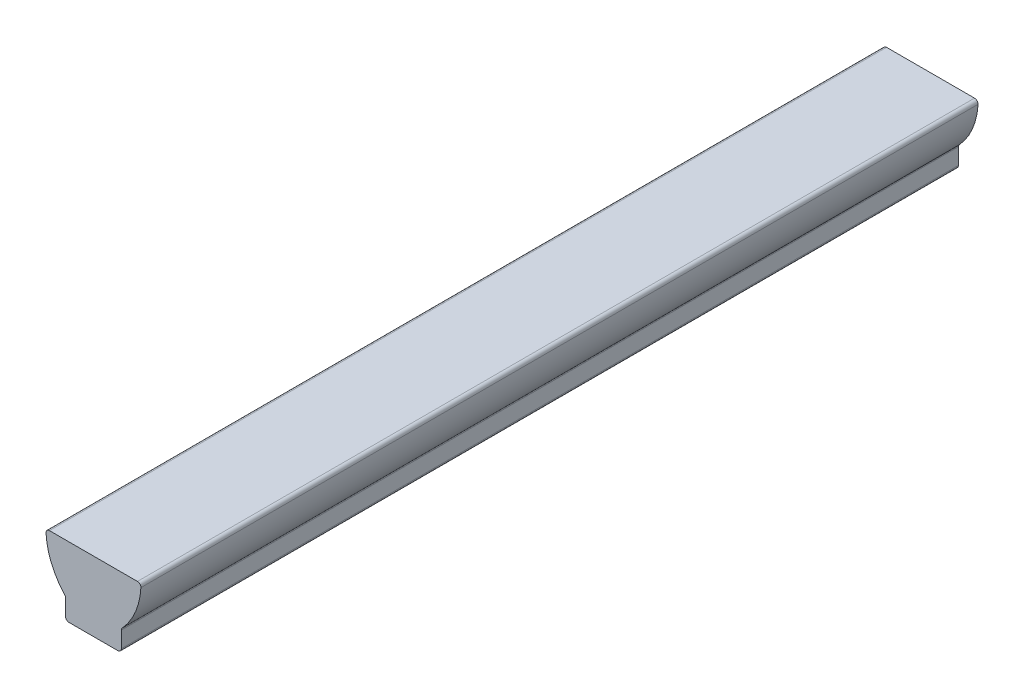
ISO-10303-21;
HEADER;
FILE_DESCRIPTION(('STEP AP214'),'2;1');
FILE_NAME('part.step','',(''),(''),'','','');
FILE_SCHEMA(('AUTOMOTIVE_DESIGN { 1 0 10303 214 1 1 1 1 }'));
ENDSEC;
DATA;
#1=APPLICATION_CONTEXT('core data for automotive mechanical design processes');
#2=APPLICATION_PROTOCOL_DEFINITION('international standard','automotive_design',2000,#1);
#3=PRODUCT_CONTEXT('',#1,'mechanical');
#4=PRODUCT('Part','Part','',(#3));
#5=PRODUCT_RELATED_PRODUCT_CATEGORY('part','',(#4));
#6=PRODUCT_DEFINITION_FORMATION('','',#4);
#7=PRODUCT_DEFINITION_CONTEXT('part definition',#1,'design');
#8=PRODUCT_DEFINITION('design','',#6,#7);
#9=PRODUCT_DEFINITION_SHAPE('','',#8);
#10=(LENGTH_UNIT() NAMED_UNIT(*) SI_UNIT(.MILLI.,.METRE.));
#11=(NAMED_UNIT(*) PLANE_ANGLE_UNIT() SI_UNIT($,.RADIAN.));
#12=(NAMED_UNIT(*) SI_UNIT($,.STERADIAN.) SOLID_ANGLE_UNIT());
#13=UNCERTAINTY_MEASURE_WITH_UNIT(LENGTH_MEASURE(1.E-05),#10,'distance_accuracy_value','');
#14=(GEOMETRIC_REPRESENTATION_CONTEXT(3) GLOBAL_UNCERTAINTY_ASSIGNED_CONTEXT((#13)) GLOBAL_UNIT_ASSIGNED_CONTEXT((#10,
#11,#12)) REPRESENTATION_CONTEXT('',''));
#15=CARTESIAN_POINT('',(0.,0.,0.));
#16=DIRECTION('',(0.,0.,1.));
#17=DIRECTION('',(1.,0.,0.));
#18=AXIS2_PLACEMENT_3D('',#15,#16,#17);
#19=CARTESIAN_POINT('',(-5.56260000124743,-14.8932834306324,189.865));
#20=CARTESIAN_POINT('',(-5.66701573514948,-14.8932834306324,189.865));
#21=CARTESIAN_POINT('',(-5.76745738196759,-14.8733043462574,189.865));
#22=CARTESIAN_POINT('',(-5.86392494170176,-14.8333461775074,189.865));
#23=CARTESIAN_POINT('',(-5.96039250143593,-14.7933880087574,189.865));
#24=CARTESIAN_POINT('',(-6.04554281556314,-14.7364923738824,189.865));
#25=CARTESIAN_POINT('',(-6.11937588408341,-14.6626593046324,189.865));
#26=CARTESIAN_POINT('',(-6.19320895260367,-14.5888262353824,189.865));
#27=CARTESIAN_POINT('',(-6.2501045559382,-14.5036759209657,189.865));
#28=CARTESIAN_POINT('',(-6.29006273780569,-14.4072083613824,189.865));
#29=CARTESIAN_POINT('',(-6.33002091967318,-14.3107408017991,189.865));
#30=CARTESIAN_POINT('',(-6.35000001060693,-14.2102991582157,189.865));
#31=CARTESIAN_POINT('',(-6.35000001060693,-14.1058834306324,189.865));
#32=CARTESIAN_POINT('',(-5.56260000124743,-14.8932834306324,-0.635));
#33=CARTESIAN_POINT('',(-5.66701573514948,-14.8932834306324,-0.635));
#34=CARTESIAN_POINT('',(-5.76745738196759,-14.8733043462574,-0.635));
#35=CARTESIAN_POINT('',(-5.86392494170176,-14.8333461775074,-0.635));
#36=CARTESIAN_POINT('',(-5.96039250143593,-14.7933880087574,-0.635));
#37=CARTESIAN_POINT('',(-6.04554281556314,-14.7364923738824,-0.635));
#38=CARTESIAN_POINT('',(-6.11937588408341,-14.6626593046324,-0.635));
#39=CARTESIAN_POINT('',(-6.19320895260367,-14.5888262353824,-0.635));
#40=CARTESIAN_POINT('',(-6.2501045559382,-14.5036759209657,-0.635));
#41=CARTESIAN_POINT('',(-6.29006273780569,-14.4072083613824,-0.635));
#42=CARTESIAN_POINT('',(-6.33002091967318,-14.3107408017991,-0.635));
#43=CARTESIAN_POINT('',(-6.35000001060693,-14.2102991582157,-0.635));
#44=CARTESIAN_POINT('',(-6.35000001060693,-14.1058834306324,-0.635));
#45=B_SPLINE_SURFACE_WITH_KNOTS('',1,3,((#19,#20,#21,#22,#23,#24,#25,#26,#27,#28,#29,#30,#31),
(#32,#33,#34,#35,#36,#37,#38,#39,#40,#41,#42,#43,#44)),.UNSPECIFIED.,.F.,.F.,.F.,(2,2),(4,3,3,3,
4),(0.,1.),(0.,0.25,0.5,0.75,1.),.UNSPECIFIED.);
#46=DIRECTION('',(0.,0.,1.));
#47=VECTOR('',#46,1.);
#48=CARTESIAN_POINT('',(-5.56260000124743,-14.8932834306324,94.615));
#49=LINE('',#48,#47);
#50=CARTESIAN_POINT('',(-5.56260000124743,-14.8932834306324,-0.635000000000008));
#51=VERTEX_POINT('',#50);
#52=CARTESIAN_POINT('',(-5.56260000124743,-14.8932834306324,189.865));
#53=VERTEX_POINT('',#52);
#54=EDGE_CURVE('E115',#51,#53,#49,.T.);
#55=CARTESIAN_POINT('',(-6.35000001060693,-14.1058834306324,189.865));
#56=CARTESIAN_POINT('',(-6.35000953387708,-14.1280868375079,189.865));
#57=CARTESIAN_POINT('',(-6.3490972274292,-14.1502942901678,189.865));
#58=CARTESIAN_POINT('',(-6.34540518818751,-14.1945444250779,189.865));
#59=CARTESIAN_POINT('',(-6.3426261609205,-14.2165871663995,189.865));
#60=CARTESIAN_POINT('',(-6.33517917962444,-14.2603389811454,189.865));
#61=CARTESIAN_POINT('',(-6.33051235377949,-14.2820482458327,189.865));
#62=CARTESIAN_POINT('',(-6.31933104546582,-14.3249869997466,189.865));
#63=CARTESIAN_POINT('',(-6.31281634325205,-14.3462164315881,189.865));
#64=CARTESIAN_POINT('',(-6.29804475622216,-14.3880604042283,189.865));
#65=CARTESIAN_POINT('',(-6.28978772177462,-14.408674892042,189.865));
#66=CARTESIAN_POINT('',(-6.27161137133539,-14.4491571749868,189.865));
#67=CARTESIAN_POINT('',(-6.26169216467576,-14.4690250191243,189.865));
#68=CARTESIAN_POINT('',(-6.24019088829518,-14.5078389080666,189.865));
#69=CARTESIAN_POINT('',(-6.22860898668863,-14.5267850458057,189.865));
#70=CARTESIAN_POINT('',(-6.2038563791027,-14.5636088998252,189.865));
#71=CARTESIAN_POINT('',(-6.19068569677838,-14.581486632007,189.865));
#72=CARTESIAN_POINT('',(-6.16290152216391,-14.6160076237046,189.865));
#73=CARTESIAN_POINT('',(-6.14829170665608,-14.6326538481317,189.865));
#74=CARTESIAN_POINT('',(-6.11776205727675,-14.6646999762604,189.865));
#75=CARTESIAN_POINT('',(-6.10184207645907,-14.6800997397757,189.865));
#76=CARTESIAN_POINT('',(-6.06876791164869,-14.7095282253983,189.865));
#77=CARTESIAN_POINT('',(-6.05161330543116,-14.7235564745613,189.865));
#78=CARTESIAN_POINT('',(-6.0161717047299,-14.7500867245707,189.865));
#79=CARTESIAN_POINT('',(-5.99788494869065,-14.7625890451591,189.865));
#80=CARTESIAN_POINT('',(-5.94141257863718,-14.7977209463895,189.865));
#81=CARTESIAN_POINT('',(-5.90168268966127,-14.8179150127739,189.865));
#82=CARTESIAN_POINT('',(-5.81948846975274,-14.8515265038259,189.865));
#83=CARTESIAN_POINT('',(-5.77702593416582,-14.8649483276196,189.865));
#84=CARTESIAN_POINT('',(-5.70565895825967,-14.8808740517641,189.865));
#85=CARTESIAN_POINT('',(-5.67722883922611,-14.8855567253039,189.865));
#86=CARTESIAN_POINT('',(-5.62006497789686,-14.8917706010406,189.865));
#87=CARTESIAN_POINT('',(-5.591331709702,-14.8933061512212,189.865));
#88=CARTESIAN_POINT('',(-5.56260000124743,-14.8932834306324,189.865));
#89=B_SPLINE_CURVE_WITH_KNOTS('',3,(#55,#56,#57,#58,#59,#60,#61,#62,#63,#64,#65,#66,#67,#68,#69,
#70,#71,#72,#73,#74,#75,#76,#77,#78,#79,#80,#81,#82,#83,#84,#85,#86,#87,#88),.UNSPECIFIED.,.F.,
.F.,(4,2,2,2,2,2,2,2,2,2,2,2,2,2,2,2,4),(0.,0.066596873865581,0.133168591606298,
0.199700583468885,0.266240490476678,0.332786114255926,0.399327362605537,0.465861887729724,
0.532395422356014,0.598763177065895,0.665138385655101,0.731536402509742,0.797920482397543,
0.930957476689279,1.06390794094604,1.15017818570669,1.23632916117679),.UNSPECIFIED.);
#90=CARTESIAN_POINT('',(-6.35000001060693,-14.1058834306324,189.865));
#91=VERTEX_POINT('',#90);
#92=EDGE_CURVE('E18',#91,#53,#89,.T.);
#93=DIRECTION('',(0.,0.,-1.));
#94=VECTOR('',#93,1.);
#95=CARTESIAN_POINT('',(-6.35000001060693,-14.1058834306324,94.615));
#96=LINE('',#95,#94);
#97=CARTESIAN_POINT('',(-6.35000001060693,-14.1058834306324,-0.635));
#98=VERTEX_POINT('',#97);
#99=EDGE_CURVE('E120',#91,#98,#96,.T.);
#100=CARTESIAN_POINT('',(-5.56260000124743,-14.8932834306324,-0.635));
#101=CARTESIAN_POINT('',(-5.5848034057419,-14.8932929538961,-0.635));
#102=CARTESIAN_POINT('',(-5.60701085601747,-14.8923806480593,-0.635));
#103=CARTESIAN_POINT('',(-5.65126098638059,-14.8886886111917,-0.635));
#104=CARTESIAN_POINT('',(-5.67330372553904,-14.8859095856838,-0.635));
#105=CARTESIAN_POINT('',(-5.71705553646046,-14.8784626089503,-0.635));
#106=CARTESIAN_POINT('',(-5.73876479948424,-14.8737957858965,-0.635));
#107=CARTESIAN_POINT('',(-5.78170355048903,-14.8626144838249,-0.635));
#108=CARTESIAN_POINT('',(-5.80293298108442,-14.8560997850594,-0.635));
#109=CARTESIAN_POINT('',(-5.84477695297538,-14.8413282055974,-0.635));
#110=CARTESIAN_POINT('',(-5.86539144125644,-14.833071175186,-0.635));
#111=CARTESIAN_POINT('',(-5.90587372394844,-14.8148948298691,-0.635));
#112=CARTESIAN_POINT('',(-5.92574156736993,-14.8049756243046,-0.635));
#113=CARTESIAN_POINT('',(-5.96455545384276,-14.7834743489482,-0.635));
#114=CARTESIAN_POINT('',(-5.98350158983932,-14.7718924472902,-0.635));
#115=CARTESIAN_POINT('',(-6.02032544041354,-14.747139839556,-0.635));
#116=CARTESIAN_POINT('',(-6.03820317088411,-14.7339691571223,-0.635));
#117=CARTESIAN_POINT('',(-6.07272415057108,-14.7061849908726,-0.635));
#118=CARTESIAN_POINT('',(-6.08937036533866,-14.6915751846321,-0.635));
#119=CARTESIAN_POINT('',(-6.12141647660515,-14.6610455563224,-0.635));
#120=CARTESIAN_POINT('',(-6.13681623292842,-14.6451255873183,-0.635));
#121=CARTESIAN_POINT('',(-6.16624470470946,-14.6120514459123,-0.635));
#122=CARTESIAN_POINT('',(-6.1802729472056,-14.5948968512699,-0.635));
#123=CARTESIAN_POINT('',(-6.20680318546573,-14.5594552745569,-0.635));
#124=CARTESIAN_POINT('',(-6.21930550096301,-14.5411685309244,-0.635));
#125=CARTESIAN_POINT('',(-6.25443740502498,-14.4846961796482,-0.635));
#126=CARTESIAN_POINT('',(-6.27463148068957,-14.4449662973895,-0.635));
#127=CARTESIAN_POINT('',(-6.30824299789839,-14.3627720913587,-0.635));
#128=CARTESIAN_POINT('',(-6.32166483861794,-14.3203095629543,-0.635));
#129=CARTESIAN_POINT('',(-6.3375905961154,-14.2489425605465,-0.635));
#130=CARTESIAN_POINT('',(-6.34227328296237,-14.2205124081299,-0.635));
#131=CARTESIAN_POINT('',(-6.34848717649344,-14.1633484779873,-0.635));
#132=CARTESIAN_POINT('',(-6.35002273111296,-14.1346151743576,-0.635));
#133=CARTESIAN_POINT('',(-6.35000001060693,-14.1058834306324,-0.635));
#134=B_SPLINE_CURVE_WITH_KNOTS('',3,(#100,#101,#102,#103,#104,#105,#106,#107,#108,#109,#110,
#111,#112,#113,#114,#115,#116,#117,#118,#119,#120,#121,#122,#123,#124,#125,#126,#127,#128,#129,
#130,#131,#132,#133),.UNSPECIFIED.,.F.,.F.,(4,2,2,2,2,2,2,2,2,2,2,2,2,2,2,2,4),(0.,
0.066596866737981,0.133168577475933,0.199700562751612,0.266240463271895,0.33278608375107,
0.399327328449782,0.465861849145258,0.532395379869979,0.598763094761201,0.665138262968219,
0.731536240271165,0.797920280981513,0.930957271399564,1.06390773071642,1.15017807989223,
1.23632916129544),.UNSPECIFIED.);
#135=EDGE_CURVE('E113',#51,#98,#134,.T.);
#136=ORIENTED_EDGE('',*,*,#54,.T.);
#137=ORIENTED_EDGE('',*,*,#92,.F.);
#138=ORIENTED_EDGE('',*,*,#99,.T.);
#139=ORIENTED_EDGE('',*,*,#135,.F.);
#140=EDGE_LOOP('',(#136,#137,#138,#139));
#141=FACE_BOUND('',#140,.T.);
#142=ADVANCED_FACE('F14',(#141),#45,.F.);
#143=CARTESIAN_POINT('',(6.35000001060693,-14.1058834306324,189.865));
#144=CARTESIAN_POINT('',(6.35000001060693,-14.2102991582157,189.865));
#145=CARTESIAN_POINT('',(6.33002090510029,-14.3107408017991,189.865));
#146=CARTESIAN_POINT('',(6.29006273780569,-14.4072083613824,189.865));
#147=CARTESIAN_POINT('',(6.2501045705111,-14.5036759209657,189.865));
#148=CARTESIAN_POINT('',(6.19320895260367,-14.5888262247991,189.865));
#149=CARTESIAN_POINT('',(6.11937588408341,-14.6626593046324,189.865));
#150=CARTESIAN_POINT('',(6.04554281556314,-14.7364923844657,189.865));
#151=CARTESIAN_POINT('',(5.96039250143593,-14.7933880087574,189.865));
#152=CARTESIAN_POINT('',(5.86392494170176,-14.8333461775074,189.865));
#153=CARTESIAN_POINT('',(5.76745738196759,-14.8733043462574,189.865));
#154=CARTESIAN_POINT('',(5.66701573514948,-14.8932834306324,189.865));
#155=CARTESIAN_POINT('',(5.56260000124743,-14.8932834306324,189.865));
#156=CARTESIAN_POINT('',(6.35000001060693,-14.1058834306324,-0.635));
#157=CARTESIAN_POINT('',(6.35000001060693,-14.2102991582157,-0.635));
#158=CARTESIAN_POINT('',(6.33002090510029,-14.3107408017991,-0.635));
#159=CARTESIAN_POINT('',(6.29006273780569,-14.4072083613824,-0.635));
#160=CARTESIAN_POINT('',(6.2501045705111,-14.5036759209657,-0.635));
#161=CARTESIAN_POINT('',(6.19320895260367,-14.5888262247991,-0.635));
#162=CARTESIAN_POINT('',(6.11937588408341,-14.6626593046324,-0.635));
#163=CARTESIAN_POINT('',(6.04554281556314,-14.7364923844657,-0.635));
#164=CARTESIAN_POINT('',(5.96039250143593,-14.7933880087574,-0.635));
#165=CARTESIAN_POINT('',(5.86392494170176,-14.8333461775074,-0.635));
#166=CARTESIAN_POINT('',(5.76745738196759,-14.8733043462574,-0.635));
#167=CARTESIAN_POINT('',(5.66701573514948,-14.8932834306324,-0.635));
#168=CARTESIAN_POINT('',(5.56260000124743,-14.8932834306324,-0.635));
#169=B_SPLINE_SURFACE_WITH_KNOTS('',1,3,((#143,#144,#145,#146,#147,#148,#149,#150,#151,#152,
#153,#154,#155),(#156,#157,#158,#159,#160,#161,#162,#163,#164,#165,#166,#167,#168)),
.UNSPECIFIED.,.F.,.F.,.F.,(2,2),(4,3,3,3,4),(0.,1.),(0.,0.25,0.5,0.75,1.),.UNSPECIFIED.);
#170=DIRECTION('',(0.,0.,1.));
#171=VECTOR('',#170,1.);
#172=CARTESIAN_POINT('',(6.35000001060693,-14.1058834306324,94.615));
#173=LINE('',#172,#171);
#174=CARTESIAN_POINT('',(6.35000001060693,-14.1058834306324,-0.635));
#175=VERTEX_POINT('',#174);
#176=CARTESIAN_POINT('',(6.35000001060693,-14.1058834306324,189.865));
#177=VERTEX_POINT('',#176);
#178=EDGE_CURVE('E154',#175,#177,#173,.T.);
#179=CARTESIAN_POINT('',(5.56260000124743,-14.8932834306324,189.865));
#180=CARTESIAN_POINT('',(5.58480340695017,-14.8932929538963,189.865));
#181=CARTESIAN_POINT('',(5.60701085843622,-14.89238064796,189.865));
#182=CARTESIAN_POINT('',(5.65126099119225,-14.8886886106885,189.865));
#183=CARTESIAN_POINT('',(5.67330373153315,-14.8859095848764,189.865));
#184=CARTESIAN_POINT('',(5.71705554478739,-14.8784626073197,189.865));
#185=CARTESIAN_POINT('',(5.7387648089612,-14.8737957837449,189.865));
#186=CARTESIAN_POINT('',(5.78170356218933,-14.8626144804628,189.865));
#187=CARTESIAN_POINT('',(5.80293299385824,-14.8560997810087,189.865));
#188=CARTESIAN_POINT('',(5.84477696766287,-14.8413281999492,189.865));
#189=CARTESIAN_POINT('',(5.86539145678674,-14.8330711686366,189.865));
#190=CARTESIAN_POINT('',(5.9058737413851,-14.8148948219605,189.865));
#191=CARTESIAN_POINT('',(5.92574158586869,-14.8049756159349,189.865));
#192=CARTESIAN_POINT('',(5.96455547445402,-14.7834743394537,189.865));
#193=CARTESIAN_POINT('',(5.98350161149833,-14.7718924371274,189.865));
#194=CARTESIAN_POINT('',(6.02032546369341,-14.7471398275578,189.865));
#195=CARTESIAN_POINT('',(6.03820319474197,-14.7339691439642,189.865));
#196=CARTESIAN_POINT('',(6.07272417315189,-14.706184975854,189.865));
#197=CARTESIAN_POINT('',(6.08937038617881,-14.6915751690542,189.865));
#198=CARTESIAN_POINT('',(6.12141649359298,-14.6610455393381,189.865));
#199=CARTESIAN_POINT('',(6.1368162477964,-14.6451255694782,189.865));
#200=CARTESIAN_POINT('',(6.16624471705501,-14.6120514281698,189.865));
#201=CARTESIAN_POINT('',(6.18027295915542,-14.594896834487,189.865));
#202=CARTESIAN_POINT('',(6.20680319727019,-14.5594552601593,189.865));
#203=CARTESIAN_POINT('',(6.21930551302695,-14.5411685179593,189.865));
#204=CARTESIAN_POINT('',(6.25443742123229,-14.484696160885,189.865));
#205=CARTESIAN_POINT('',(6.27463149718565,-14.4449662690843,189.865));
#206=CARTESIAN_POINT('',(6.3082430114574,-14.3627720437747,189.865));
#207=CARTESIAN_POINT('',(6.32166484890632,-14.3203095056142,189.865));
#208=CARTESIAN_POINT('',(6.33759060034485,-14.2489425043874,189.865));
#209=CARTESIAN_POINT('',(6.34227328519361,-14.2205123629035,189.865));
#210=CARTESIAN_POINT('',(6.34848717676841,-14.1633484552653,189.865));
#211=CARTESIAN_POINT('',(6.35002273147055,-14.1346151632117,189.865));
#212=CARTESIAN_POINT('',(6.35000001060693,-14.1058834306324,189.865));
#213=B_SPLINE_CURVE_WITH_KNOTS('',3,(#179,#180,#181,#182,#183,#184,#185,#186,#187,#188,#189,
#190,#191,#192,#193,#194,#195,#196,#197,#198,#199,#200,#201,#202,#203,#204,#205,#206,#207,#208,
#209,#210,#211,#212),.UNSPECIFIED.,.F.,.F.,(4,2,2,2,2,2,2,2,2,2,2,2,2,2,2,2,4),(0.,
0.066596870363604,0.133168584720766,0.199700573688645,0.266240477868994,0.332786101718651,
0.399327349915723,0.465861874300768,0.532395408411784,0.598763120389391,0.66513828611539,
0.731536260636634,0.797920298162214,0.930957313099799,1.06390779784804,1.15017811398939,
1.23632916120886),.UNSPECIFIED.);
#214=CARTESIAN_POINT('',(5.56260000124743,-14.8932834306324,189.865));
#215=VERTEX_POINT('',#214);
#216=EDGE_CURVE('E259',#215,#177,#213,.T.);
#217=DIRECTION('',(0.,0.,-1.));
#218=VECTOR('',#217,1.);
#219=CARTESIAN_POINT('',(5.56260000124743,-14.8932834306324,94.615));
#220=LINE('',#219,#218);
#221=CARTESIAN_POINT('',(5.56260000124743,-14.8932834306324,-0.635000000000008));
#222=VERTEX_POINT('',#221);
#223=EDGE_CURVE('E119',#215,#222,#220,.T.);
#224=CARTESIAN_POINT('',(6.35000001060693,-14.1058834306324,-0.635));
#225=CARTESIAN_POINT('',(6.35000953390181,-14.1280868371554,-0.635));
#226=CARTESIAN_POINT('',(6.3490972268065,-14.1502942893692,-0.635));
#227=CARTESIAN_POINT('',(6.34540518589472,-14.1945444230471,-0.635));
#228=CARTESIAN_POINT('',(6.34262615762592,-14.2165871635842,-0.635));
#229=CARTESIAN_POINT('',(6.33517917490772,-14.260338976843,-0.635));
#230=CARTESIAN_POINT('',(6.33051234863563,-14.2820482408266,-0.635));
#231=CARTESIAN_POINT('',(6.31933104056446,-14.3249869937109,-0.635));
#232=CARTESIAN_POINT('',(6.31281633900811,-14.3462164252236,-0.635));
#233=CARTESIAN_POINT('',(6.29804475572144,-14.3880603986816,-0.635));
#234=CARTESIAN_POINT('',(6.28978772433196,-14.4086748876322,-0.635));
#235=CARTESIAN_POINT('',(6.2716113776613,-14.4491571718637,-0.635));
#236=CARTESIAN_POINT('',(6.26169217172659,-14.4690250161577,-0.635));
#237=CARTESIAN_POINT('',(6.24019089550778,-14.5078389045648,-0.635));
#238=CARTESIAN_POINT('',(6.22860899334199,-14.5267850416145,-0.635));
#239=CARTESIAN_POINT('',(6.20385638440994,-14.563608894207,-0.635));
#240=CARTESIAN_POINT('',(6.19068570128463,-14.5814866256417,-0.635));
#241=CARTESIAN_POINT('',(6.16290153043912,-14.6160076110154,-0.635));
#242=CARTESIAN_POINT('',(6.14829171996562,-14.6326538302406,-0.635));
#243=CARTESIAN_POINT('',(6.11776208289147,-14.6646999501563,-0.635));
#244=CARTESIAN_POINT('',(6.10184210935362,-14.680099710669,-0.635));
#245=CARTESIAN_POINT('',(6.0687679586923,-14.7095281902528,-0.635));
#246=CARTESIAN_POINT('',(6.05161335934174,-14.7235564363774,-0.635));
#247=CARTESIAN_POINT('',(6.01617177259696,-14.7500866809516,-0.635));
#248=CARTESIAN_POINT('',(5.99788502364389,-14.7625889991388,-0.635));
#249=CARTESIAN_POINT('',(5.94141266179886,-14.7977209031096,-0.635));
#250=CARTESIAN_POINT('',(5.90168277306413,-14.8179149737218,-0.635));
#251=CARTESIAN_POINT('',(5.81948855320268,-14.8515264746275,-0.635));
#252=CARTESIAN_POINT('',(5.77702601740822,-14.8649483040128,-0.635));
#253=CARTESIAN_POINT('',(5.7056590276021,-14.8808740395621,-0.635));
#254=CARTESIAN_POINT('',(5.67722889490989,-14.885556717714,-0.635));
#255=CARTESIAN_POINT('',(5.6200650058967,-14.8917705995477,-0.635));
#256=CARTESIAN_POINT('',(5.59133172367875,-14.8933061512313,-0.635));
#257=CARTESIAN_POINT('',(5.56260000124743,-14.8932834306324,-0.635));
#258=B_SPLINE_CURVE_WITH_KNOTS('',3,(#224,#225,#226,#227,#228,#229,#230,#231,#232,#233,#234,
#235,#236,#237,#238,#239,#240,#241,#242,#243,#244,#245,#246,#247,#248,#249,#250,#251,#252,#253,
#254,#255,#256,#257),.UNSPECIFIED.,.F.,.F.,(4,2,2,2,2,2,2,2,2,2,2,2,2,2,2,2,4),(0.,
0.0665968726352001,0.133168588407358,0.199700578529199,0.266240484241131,0.33278610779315,
0.399327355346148,0.465861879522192,0.532395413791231,0.598763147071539,0.665138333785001,
0.731536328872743,0.797920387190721,0.930957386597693,1.0639078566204,1.15017814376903,
1.23632916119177),.UNSPECIFIED.);
#259=EDGE_CURVE('E265',#175,#222,#258,.T.);
#260=ORIENTED_EDGE('',*,*,#178,.T.);
#261=ORIENTED_EDGE('',*,*,#216,.F.);
#262=ORIENTED_EDGE('',*,*,#223,.T.);
#263=ORIENTED_EDGE('',*,*,#259,.F.);
#264=EDGE_LOOP('',(#260,#261,#262,#263));
#265=FACE_BOUND('',#264,.T.);
#266=ADVANCED_FACE('F274',(#265),#169,.F.);
#267=CARTESIAN_POINT('',(7.13739983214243,-10.4431527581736,189.865));
#268=DIRECTION('',(0.,0.,-1.));
#269=DIRECTION('',(-1.,0.,0.));
#270=AXIS2_PLACEMENT_3D('',#267,#268,#269);
#271=CYLINDRICAL_SURFACE('',#270,0.787399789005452);
#272=DIRECTION('',(0.,0.,1.));
#273=VECTOR('',#272,1.);
#274=CARTESIAN_POINT('',(6.55909646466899,-9.90877120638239,94.615));
#275=LINE('',#274,#273);
#276=CARTESIAN_POINT('',(6.559096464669,-9.9087712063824,-0.635));
#277=VERTEX_POINT('',#276);
#278=CARTESIAN_POINT('',(6.559096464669,-9.9087712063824,189.865));
#279=VERTEX_POINT('',#278);
#280=EDGE_CURVE('E150',#277,#279,#275,.T.);
#281=ORIENTED_EDGE('',*,*,#280,.T.);
#282=CARTESIAN_POINT('',(7.13739983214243,-10.4431527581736,189.865));
#283=DIRECTION('',(0.,0.,-1.));
#284=DIRECTION('',(-1.,0.,0.));
#285=AXIS2_PLACEMENT_3D('',#282,#283,#284);
#286=CIRCLE('',#285,0.787399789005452);
#287=CARTESIAN_POINT('',(6.35000001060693,-10.443152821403,189.865));
#288=VERTEX_POINT('',#287);
#289=EDGE_CURVE('E394',#288,#279,#286,.T.);
#290=ORIENTED_EDGE('',*,*,#289,.F.);
#291=DIRECTION('',(0.,0.,-1.));
#292=VECTOR('',#291,1.);
#293=CARTESIAN_POINT('',(6.35000001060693,-10.4431528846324,94.615));
#294=LINE('',#293,#292);
#295=CARTESIAN_POINT('',(6.35000001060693,-10.443152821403,-0.635));
#296=VERTEX_POINT('',#295);
#297=EDGE_CURVE('E153',#288,#296,#294,.T.);
#298=ORIENTED_EDGE('',*,*,#297,.T.);
#299=CARTESIAN_POINT('',(7.13739983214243,-10.4431527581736,-0.635));
#300=DIRECTION('',(0.,0.,-1.));
#301=DIRECTION('',(-1.,0.,0.));
#302=AXIS2_PLACEMENT_3D('',#299,#300,#301);
#303=CIRCLE('',#302,0.787399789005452);
#304=EDGE_CURVE('E161',#277,#296,#303,.F.);
#305=ORIENTED_EDGE('',*,*,#304,.F.);
#306=EDGE_LOOP('',(#281,#290,#298,#305));
#307=FACE_BOUND('',#306,.T.);
#308=ADVANCED_FACE('F279',(#307),#271,.F.);
#309=CARTESIAN_POINT('',(-6.35000001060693,-14.1058834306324,189.865));
#310=DIRECTION('',(1.,0.,0.));
#311=DIRECTION('',(0.,0.,-1.));
#312=AXIS2_PLACEMENT_3D('',#309,#310,#311);
#313=PLANE('',#312);
#314=ORIENTED_EDGE('',*,*,#99,.F.);
#315=DIRECTION('',(0.,1.,0.));
#316=VECTOR('',#315,1.);
#317=CARTESIAN_POINT('',(-6.35000001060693,-6.9557834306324,189.865));
#318=LINE('',#317,#316);
#319=CARTESIAN_POINT('',(-6.35000001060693,-10.4431528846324,189.865));
#320=VERTEX_POINT('',#319);
#321=EDGE_CURVE('E112',#91,#320,#318,.T.);
#322=ORIENTED_EDGE('',*,*,#321,.T.);
#323=DIRECTION('',(0.,0.,-1.));
#324=VECTOR('',#323,1.);
#325=CARTESIAN_POINT('',(-6.35000001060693,-10.4431528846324,94.615));
#326=LINE('',#325,#324);
#327=CARTESIAN_POINT('',(-6.35000001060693,-10.4431528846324,-0.635));
#328=VERTEX_POINT('',#327);
#329=EDGE_CURVE('E149',#320,#328,#326,.T.);
#330=ORIENTED_EDGE('',*,*,#329,.T.);
#331=DIRECTION('',(0.,-1.,0.));
#332=VECTOR('',#331,1.);
#333=CARTESIAN_POINT('',(-6.35000001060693,-6.9557834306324,-0.635));
#334=LINE('',#333,#332);
#335=EDGE_CURVE('E348',#328,#98,#334,.T.);
#336=ORIENTED_EDGE('',*,*,#335,.T.);
#337=EDGE_LOOP('',(#314,#322,#330,#336));
#338=FACE_BOUND('',#337,.T.);
#339=ADVANCED_FACE('F300',(#338),#313,.F.);
#340=CARTESIAN_POINT('',(5.56260000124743,-14.8932834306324,189.865));
#341=DIRECTION('',(0.,1.,0.));
#342=DIRECTION('',(0.,0.,-1.));
#343=AXIS2_PLACEMENT_3D('',#340,#341,#342);
#344=PLANE('',#343);
#345=ORIENTED_EDGE('',*,*,#223,.F.);
#346=DIRECTION('',(-1.,0.,0.));
#347=VECTOR('',#346,1.);
#348=CARTESIAN_POINT('',(0.108862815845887,-14.8932834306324,189.865));
#349=LINE('',#348,#347);
#350=EDGE_CURVE('E109',#215,#53,#349,.T.);
#351=ORIENTED_EDGE('',*,*,#350,.T.);
#352=ORIENTED_EDGE('',*,*,#54,.F.);
#353=DIRECTION('',(1.,0.,0.));
#354=VECTOR('',#353,1.);
#355=CARTESIAN_POINT('',(0.108862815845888,-14.8932834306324,-0.635));
#356=LINE('',#355,#354);
#357=EDGE_CURVE('E360',#51,#222,#356,.T.);
#358=ORIENTED_EDGE('',*,*,#357,.T.);
#359=EDGE_LOOP('',(#345,#351,#352,#358));
#360=FACE_BOUND('',#359,.T.);
#361=ADVANCED_FACE('F123',(#360),#344,.F.);
#362=CARTESIAN_POINT('',(6.35000001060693,-10.4431528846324,189.865));
#363=DIRECTION('',(-1.,0.,0.));
#364=DIRECTION('',(0.,0.,-1.));
#365=AXIS2_PLACEMENT_3D('',#362,#363,#364);
#366=PLANE('',#365);
#367=ORIENTED_EDGE('',*,*,#297,.F.);
#368=DIRECTION('',(0.,-1.,0.));
#369=VECTOR('',#368,1.);
#370=CARTESIAN_POINT('',(6.35000001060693,-6.95578343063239,189.865));
#371=LINE('',#370,#369);
#372=EDGE_CURVE('E125',#288,#177,#371,.T.);
#373=ORIENTED_EDGE('',*,*,#372,.T.);
#374=ORIENTED_EDGE('',*,*,#178,.F.);
#375=DIRECTION('',(0.,1.,0.));
#376=VECTOR('',#375,1.);
#377=CARTESIAN_POINT('',(6.35000001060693,-6.95578343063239,-0.635));
#378=LINE('',#377,#376);
#379=EDGE_CURVE('E355',#175,#296,#378,.T.);
#380=ORIENTED_EDGE('',*,*,#379,.T.);
#381=EDGE_LOOP('',(#367,#373,#374,#380));
#382=FACE_BOUND('',#381,.T.);
#383=ADVANCED_FACE('F306',(#382),#366,.F.);
#384=CARTESIAN_POINT('',(10.7990223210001,0.15368622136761,189.865));
#385=CARTESIAN_POINT('',(10.7509917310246,-0.775887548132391,189.865));
#386=CARTESIAN_POINT('',(10.6230486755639,-1.69432915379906,189.865));
#387=CARTESIAN_POINT('',(10.4151931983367,-2.60163859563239,189.865));
#388=CARTESIAN_POINT('',(10.2073377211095,-3.50894803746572,189.865));
#389=CARTESIAN_POINT('',(9.9226932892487,-4.39149091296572,189.865));
#390=CARTESIAN_POINT('',(9.56125990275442,-5.24926725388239,189.865));
#391=CARTESIAN_POINT('',(9.19982651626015,-6.10704359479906,189.865));
#392=CARTESIAN_POINT('',(8.76703555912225,-6.92716331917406,189.865));
#393=CARTESIAN_POINT('',(8.26288698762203,-7.70962645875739,189.865));
#394=CARTESIAN_POINT('',(7.75873841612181,-8.49208959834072,189.865));
#395=CARTESIAN_POINT('',(7.19080824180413,-9.22513784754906,189.865));
#396=CARTESIAN_POINT('',(6.55909646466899,-9.90877120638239,189.865));
#397=CARTESIAN_POINT('',(10.7990223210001,0.15368622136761,-0.635));
#398=CARTESIAN_POINT('',(10.7509917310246,-0.775887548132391,-0.635));
#399=CARTESIAN_POINT('',(10.6230486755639,-1.69432915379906,-0.635));
#400=CARTESIAN_POINT('',(10.4151931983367,-2.60163859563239,-0.635));
#401=CARTESIAN_POINT('',(10.2073377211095,-3.50894803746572,-0.635));
#402=CARTESIAN_POINT('',(9.9226932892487,-4.39149091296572,-0.635));
#403=CARTESIAN_POINT('',(9.56125990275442,-5.24926725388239,-0.635));
#404=CARTESIAN_POINT('',(9.19982651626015,-6.10704359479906,-0.635));
#405=CARTESIAN_POINT('',(8.76703555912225,-6.92716331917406,-0.635));
#406=CARTESIAN_POINT('',(8.26288698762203,-7.70962645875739,-0.635));
#407=CARTESIAN_POINT('',(7.75873841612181,-8.49208959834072,-0.635));
#408=CARTESIAN_POINT('',(7.19080824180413,-9.22513784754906,-0.635));
#409=CARTESIAN_POINT('',(6.55909646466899,-9.90877120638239,-0.635));
#410=B_SPLINE_SURFACE_WITH_KNOTS('',1,3,((#384,#385,#386,#387,#388,#389,#390,#391,#392,#393,
#394,#395,#396),(#397,#398,#399,#400,#401,#402,#403,#404,#405,#406,#407,#408,#409)),
.UNSPECIFIED.,.F.,.F.,.F.,(2,2),(4,3,3,3,4),(0.,1.),(0.,0.25,0.5,0.75,1.),.UNSPECIFIED.);
#411=DIRECTION('',(0.,0.,1.));
#412=VECTOR('',#411,1.);
#413=CARTESIAN_POINT('',(10.7990223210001,0.15368622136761,94.615));
#414=LINE('',#413,#412);
#415=CARTESIAN_POINT('',(10.7990223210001,0.15368622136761,-0.635));
#416=VERTEX_POINT('',#415);
#417=CARTESIAN_POINT('',(10.7990223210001,0.15368622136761,189.865));
#418=VERTEX_POINT('',#417);
#419=EDGE_CURVE('E146',#416,#418,#414,.T.);
#420=CARTESIAN_POINT('',(10.7990223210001,0.15368622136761,189.865));
#421=CARTESIAN_POINT('',(10.7869712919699,-0.0796951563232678,189.865));
#422=CARTESIAN_POINT('',(10.7698448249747,-0.312787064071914,189.865));
#423=CARTESIAN_POINT('',(10.7254316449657,-0.777946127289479,189.865));
#424=CARTESIAN_POINT('',(10.6981472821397,-1.01001350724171,189.865));
#425=CARTESIAN_POINT('',(10.6009019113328,-1.70509799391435,189.865));
#426=CARTESIAN_POINT('',(10.515596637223,-2.16606077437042,189.865));
#427=CARTESIAN_POINT('',(10.3091138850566,-3.06196774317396,189.865));
#428=CARTESIAN_POINT('',(10.1893702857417,-3.49724548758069,189.865));
#429=CARTESIAN_POINT('',(9.91337996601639,-4.35628497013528,189.865));
#430=CARTESIAN_POINT('',(9.7571184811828,-4.78004197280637,189.865));
#431=CARTESIAN_POINT('',(9.40963041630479,-5.61300411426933,189.865));
#432=CARTESIAN_POINT('',(9.21840147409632,-6.02220826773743,189.865));
#433=CARTESIAN_POINT('',(8.80205422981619,-6.82276304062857,189.865));
#434=CARTESIAN_POINT('',(8.57694930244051,-7.21412062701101,189.865));
#435=CARTESIAN_POINT('',(8.07530346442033,-8.00729580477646,189.865));
#436=CARTESIAN_POINT('',(7.79608350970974,-8.40742903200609,189.865));
#437=CARTESIAN_POINT('',(7.35113782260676,-8.98668212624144,189.865));
#438=CARTESIAN_POINT('',(7.19863697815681,-9.1760947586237,189.865));
#439=CARTESIAN_POINT('',(6.88514729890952,-9.54783522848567,189.865));
#440=CARTESIAN_POINT('',(6.72415653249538,-9.73016143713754,189.865));
#441=CARTESIAN_POINT('',(6.55909646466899,-9.90877120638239,189.865));
#442=B_SPLINE_CURVE_WITH_KNOTS('',3,(#420,#421,#422,#423,#424,#425,#426,#427,#428,#429,#430,
#431,#432,#433,#434,#435,#436,#437,#438,#439,#440,#441),.UNSPECIFIED.,.F.,.F.,(4,2,2,2,2,2,2,2,
2,2,4),(0.,0.700965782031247,1.40176948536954,2.80618076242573,4.15896775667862,
5.51230264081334,6.86572898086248,8.21862236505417,9.68017357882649,10.4094787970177,
11.1389506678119),.UNSPECIFIED.);
#443=EDGE_CURVE('E130',#418,#279,#442,.T.);
#444=CARTESIAN_POINT('',(6.55909646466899,-9.90877120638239,-0.635));
#445=CARTESIAN_POINT('',(6.71770113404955,-9.73714179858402,-0.635));
#446=CARTESIAN_POINT('',(6.87255370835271,-9.5620822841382,-0.635));
#447=CARTESIAN_POINT('',(7.17442907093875,-9.20540771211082,-0.635));
#448=CARTESIAN_POINT('',(7.32145366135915,-9.02379417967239,-0.635));
#449=CARTESIAN_POINT('',(7.75097684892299,-8.46871856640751,-0.635));
#450=CARTESIAN_POINT('',(8.02128806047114,-8.08571005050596,-0.635));
#451=CARTESIAN_POINT('',(8.51823511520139,-7.31219337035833,-0.635));
#452=CARTESIAN_POINT('',(8.74611116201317,-6.9224784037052,-0.635));
#453=CARTESIAN_POINT('',(9.16812614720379,-6.12496799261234,-0.635));
#454=CARTESIAN_POINT('',(9.36225138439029,-5.71716528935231,-0.635));
#455=CARTESIAN_POINT('',(9.71566634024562,-4.88670049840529,-0.635));
#456=CARTESIAN_POINT('',(9.8749537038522,-4.46403740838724,-0.635));
#457=CARTESIAN_POINT('',(10.1570813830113,-3.60692775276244,-0.635));
#458=CARTESIAN_POINT('',(10.2799360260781,-3.17248589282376,-0.635));
#459=CARTESIAN_POINT('',(10.4972057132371,-2.25948573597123,-0.635));
#460=CARTESIAN_POINT('',(10.5885441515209,-1.78018659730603,-0.635));
#461=CARTESIAN_POINT('',(10.6923205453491,-1.05717812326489,-0.635));
#462=CARTESIAN_POINT('',(10.7213615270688,-0.815744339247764,-0.635));
#463=CARTESIAN_POINT('',(10.7684447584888,-0.331750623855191,-0.635));
#464=CARTESIAN_POINT('',(10.7864844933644,-0.0891904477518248,-0.635));
#465=CARTESIAN_POINT('',(10.7990223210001,0.15368622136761,-0.635));
#466=B_SPLINE_CURVE_WITH_KNOTS('',3,(#444,#445,#446,#447,#448,#449,#450,#451,#452,#453,#454,
#455,#456,#457,#458,#459,#460,#461,#462,#463,#464,#465),.UNSPECIFIED.,.F.,.F.,(4,2,2,2,2,2,2,2,
2,2,4),(0.,0.700965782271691,1.40176948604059,2.80618076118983,4.1589677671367,5.51230266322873,
6.86572901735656,8.21862241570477,9.68017360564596,10.4094788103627,11.1389506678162),.UNSPECIFIED.);
#467=EDGE_CURVE('E349',#277,#416,#466,.T.);
#468=ORIENTED_EDGE('',*,*,#419,.T.);
#469=ORIENTED_EDGE('',*,*,#443,.T.);
#470=ORIENTED_EDGE('',*,*,#280,.F.);
#471=ORIENTED_EDGE('',*,*,#467,.T.);
#472=EDGE_LOOP('',(#468,#469,#470,#471));
#473=FACE_BOUND('',#472,.T.);
#474=ADVANCED_FACE('F205',(#473),#410,.F.);
#475=CARTESIAN_POINT('',(-7.13739994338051,-10.4431528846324,189.865));
#476=DIRECTION('',(0.,0.,-1.));
#477=DIRECTION('',(-1.,0.,0.));
#478=AXIS2_PLACEMENT_3D('',#475,#476,#477);
#479=CYLINDRICAL_SURFACE('',#478,0.787399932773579);
#480=ORIENTED_EDGE('',*,*,#329,.F.);
#481=CARTESIAN_POINT('',(-7.13739994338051,-10.4431528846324,189.865));
#482=DIRECTION('',(0.,0.,-1.));
#483=DIRECTION('',(-1.,0.,0.));
#484=AXIS2_PLACEMENT_3D('',#481,#482,#483);
#485=CIRCLE('',#484,0.787399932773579);
#486=CARTESIAN_POINT('',(-6.55909647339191,-9.9087712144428,189.865));
#487=VERTEX_POINT('',#486);
#488=EDGE_CURVE('E127',#320,#487,#485,.F.);
#489=ORIENTED_EDGE('',*,*,#488,.T.);
#490=DIRECTION('',(0.,0.,-1.));
#491=VECTOR('',#490,1.);
#492=CARTESIAN_POINT('',(-6.55909646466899,-9.90877120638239,94.615));
#493=LINE('',#492,#491);
#494=CARTESIAN_POINT('',(-6.55909647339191,-9.9087712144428,-0.635));
#495=VERTEX_POINT('',#494);
#496=EDGE_CURVE('E138',#487,#495,#493,.T.);
#497=ORIENTED_EDGE('',*,*,#496,.T.);
#498=CARTESIAN_POINT('',(-7.13739994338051,-10.4431528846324,-0.635));
#499=DIRECTION('',(0.,0.,-1.));
#500=DIRECTION('',(-1.,0.,0.));
#501=AXIS2_PLACEMENT_3D('',#498,#499,#500);
#502=CIRCLE('',#501,0.787399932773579);
#503=EDGE_CURVE('E346',#495,#328,#502,.T.);
#504=ORIENTED_EDGE('',*,*,#503,.T.);
#505=EDGE_LOOP('',(#480,#489,#497,#504));
#506=FACE_BOUND('',#505,.T.);
#507=ADVANCED_FACE('F203',(#506),#479,.F.);
#508=CARTESIAN_POINT('',(10.0126712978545,0.981716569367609,189.865));
#509=CARTESIAN_POINT('',(10.0660833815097,0.981716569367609,189.865));
#510=CARTESIAN_POINT('',(10.1189481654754,0.97633757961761,189.865));
#511=CARTESIAN_POINT('',(10.1712656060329,0.96557956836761,189.865));
#512=CARTESIAN_POINT('',(10.2235830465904,0.954821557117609,189.865));
#513=CARTESIAN_POINT('',(10.2742810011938,0.938905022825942,189.865));
#514=CARTESIAN_POINT('',(10.3233594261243,0.917829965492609,189.865));
#515=CARTESIAN_POINT('',(10.3724378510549,0.896754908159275,189.865));
#516=CARTESIAN_POINT('',(10.418890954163,0.870953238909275,189.865));
#517=CARTESIAN_POINT('',(10.4627187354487,0.840424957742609,189.865));
#518=CARTESIAN_POINT('',(10.5065465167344,0.809896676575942,189.865));
#519=CARTESIAN_POINT('',(10.5468507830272,0.775267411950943,189.865));
#520=CARTESIAN_POINT('',(10.5836314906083,0.736537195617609,189.865));
#521=CARTESIAN_POINT('',(10.6204121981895,0.697806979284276,189.865));
#522=CARTESIAN_POINT('',(10.652915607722,0.655769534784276,189.865));
#523=CARTESIAN_POINT('',(10.6811416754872,0.610424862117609,189.865));
#524=CARTESIAN_POINT('',(10.7093677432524,0.565080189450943,189.865));
#525=CARTESIAN_POINT('',(10.7327380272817,0.517357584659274,189.865));
#526=CARTESIAN_POINT('',(10.7512525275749,0.467257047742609,189.865));
#527=CARTESIAN_POINT('',(10.7697670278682,0.417156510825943,189.865));
#528=CARTESIAN_POINT('',(10.7830463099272,0.365704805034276,189.865));
#529=CARTESIAN_POINT('',(10.7910903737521,0.31290193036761,189.865));
#530=CARTESIAN_POINT('',(10.7991344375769,0.260099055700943,189.865));
#531=CARTESIAN_POINT('',(10.8017784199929,0.207027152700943,189.865));
#532=CARTESIAN_POINT('',(10.7990223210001,0.15368622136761,189.865));
#533=CARTESIAN_POINT('',(10.0126712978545,0.981716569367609,-0.635));
#534=CARTESIAN_POINT('',(10.0660833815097,0.981716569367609,-0.635));
#535=CARTESIAN_POINT('',(10.1189481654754,0.97633757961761,-0.635));
#536=CARTESIAN_POINT('',(10.1712656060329,0.96557956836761,-0.635));
#537=CARTESIAN_POINT('',(10.2235830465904,0.954821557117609,-0.635));
#538=CARTESIAN_POINT('',(10.2742810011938,0.938905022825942,-0.635));
#539=CARTESIAN_POINT('',(10.3233594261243,0.917829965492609,-0.635));
#540=CARTESIAN_POINT('',(10.3724378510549,0.896754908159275,-0.635));
#541=CARTESIAN_POINT('',(10.418890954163,0.870953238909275,-0.635));
#542=CARTESIAN_POINT('',(10.4627187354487,0.840424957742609,-0.635));
#543=CARTESIAN_POINT('',(10.5065465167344,0.809896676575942,-0.635));
#544=CARTESIAN_POINT('',(10.5468507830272,0.775267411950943,-0.635));
#545=CARTESIAN_POINT('',(10.5836314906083,0.736537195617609,-0.635));
#546=CARTESIAN_POINT('',(10.6204121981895,0.697806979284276,-0.635));
#547=CARTESIAN_POINT('',(10.652915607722,0.655769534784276,-0.635));
#548=CARTESIAN_POINT('',(10.6811416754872,0.610424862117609,-0.635));
#549=CARTESIAN_POINT('',(10.7093677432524,0.565080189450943,-0.635));
#550=CARTESIAN_POINT('',(10.7327380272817,0.517357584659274,-0.635));
#551=CARTESIAN_POINT('',(10.7512525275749,0.467257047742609,-0.635));
#552=CARTESIAN_POINT('',(10.7697670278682,0.417156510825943,-0.635));
#553=CARTESIAN_POINT('',(10.7830463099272,0.365704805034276,-0.635));
#554=CARTESIAN_POINT('',(10.7910903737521,0.31290193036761,-0.635));
#555=CARTESIAN_POINT('',(10.7991344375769,0.260099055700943,-0.635));
#556=CARTESIAN_POINT('',(10.8017784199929,0.207027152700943,-0.635));
#557=CARTESIAN_POINT('',(10.7990223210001,0.15368622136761,-0.635));
#558=B_SPLINE_SURFACE_WITH_KNOTS('',1,3,((#508,#509,#510,#511,#512,#513,#514,#515,#516,#517,
#518,#519,#520,#521,#522,#523,#524,#525,#526,#527,#528,#529,#530,#531,#532),(#533,#534,#535,
#536,#537,#538,#539,#540,#541,#542,#543,#544,#545,#546,#547,#548,#549,#550,#551,#552,#553,#554,
#555,#556,#557)),.UNSPECIFIED.,.F.,.F.,.F.,(2,2),(4,3,3,3,3,3,3,3,4),(0.,1.),(0.,0.125,0.25,
0.375,0.5,0.625,0.75,0.875,1.),.UNSPECIFIED.);
#559=DIRECTION('',(0.,0.,1.));
#560=VECTOR('',#559,1.);
#561=CARTESIAN_POINT('',(10.0126712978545,0.981716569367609,94.615));
#562=LINE('',#561,#560);
#563=CARTESIAN_POINT('',(10.0126712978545,0.981716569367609,-0.635));
#564=VERTEX_POINT('',#563);
#565=CARTESIAN_POINT('',(10.0126712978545,0.981716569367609,189.865));
#566=VERTEX_POINT('',#565);
#567=EDGE_CURVE('E137',#564,#566,#562,.T.);
#568=CARTESIAN_POINT('',(10.0126712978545,0.981716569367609,189.865));
#569=CARTESIAN_POINT('',(10.0569709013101,0.981751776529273,189.865));
#570=CARTESIAN_POINT('',(10.1012493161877,0.977981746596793,189.865));
#571=CARTESIAN_POINT('',(10.1885194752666,0.963099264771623,189.865));
#572=CARTESIAN_POINT('',(10.2315122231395,0.951992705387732,189.865));
#573=CARTESIAN_POINT('',(10.3150607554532,0.922697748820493,189.865));
#574=CARTESIAN_POINT('',(10.3556154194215,0.904506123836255,189.865));
#575=CARTESIAN_POINT('',(10.4136693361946,0.872329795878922,189.865));
#576=CARTESIAN_POINT('',(10.4325598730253,0.86078774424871,189.865));
#577=CARTESIAN_POINT('',(10.4693280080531,0.836153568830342,189.865));
#578=CARTESIAN_POINT('',(10.4872046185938,0.823059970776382,189.865));
#579=CARTESIAN_POINT('',(10.5390938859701,0.781561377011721,189.865));
#580=CARTESIAN_POINT('',(10.5713719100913,0.750935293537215,189.865));
#581=CARTESIAN_POINT('',(10.6303089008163,0.684713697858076,189.865));
#582=CARTESIAN_POINT('',(10.6569678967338,0.649118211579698,189.865));
#583=CARTESIAN_POINT('',(10.7038972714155,0.574005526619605,189.865));
#584=CARTESIAN_POINT('',(10.7241766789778,0.534493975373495,189.865));
#585=CARTESIAN_POINT('',(10.7578141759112,0.45263146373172,189.865));
#586=CARTESIAN_POINT('',(10.7711740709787,0.410281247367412,189.865));
#587=CARTESIAN_POINT('',(10.7887473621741,0.332168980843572,189.865));
#588=CARTESIAN_POINT('',(10.794216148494,0.296683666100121,189.865));
#589=CARTESIAN_POINT('',(10.8002846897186,0.225322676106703,189.865));
#590=CARTESIAN_POINT('',(10.8008875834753,0.189447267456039,189.865));
#591=CARTESIAN_POINT('',(10.7990223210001,0.153686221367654,189.865));
#592=B_SPLINE_CURVE_WITH_KNOTS('',3,(#568,#569,#570,#571,#572,#573,#574,#575,#576,#577,#578,
#579,#580,#581,#582,#583,#584,#585,#586,#587,#588,#589,#590,#591),.UNSPECIFIED.,.F.,.F.,(4,2,2,
2,2,2,2,2,2,2,2,4),(0.,0.132702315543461,0.265298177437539,0.39795451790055,0.464299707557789,
0.530708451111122,0.663505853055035,0.796302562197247,0.928910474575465,1.06148376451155,
1.16887309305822,1.27619314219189),.UNSPECIFIED.);
#593=EDGE_CURVE('E148',#566,#418,#592,.T.);
#594=CARTESIAN_POINT('',(10.7990223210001,0.15368622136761,-0.635));
#595=CARTESIAN_POINT('',(10.8013433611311,0.197924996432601,-0.635));
#596=CARTESIAN_POINT('',(10.7998631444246,0.242338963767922,-0.635));
#597=CARTESIAN_POINT('',(10.7895036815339,0.330260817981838,-0.635));
#598=CARTESIAN_POINT('',(10.7806303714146,0.373769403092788,-0.635));
#599=CARTESIAN_POINT('',(10.7556855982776,0.458718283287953,-0.635));
#600=CARTESIAN_POINT('',(10.7396108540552,0.500157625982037,-0.635));
#601=CARTESIAN_POINT('',(10.7104730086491,0.559794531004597,-0.635));
#602=CARTESIAN_POINT('',(10.6999210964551,0.57925548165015,-0.635));
#603=CARTESIAN_POINT('',(10.6772169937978,0.617245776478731,-0.635));
#604=CARTESIAN_POINT('',(10.6650632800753,0.635774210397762,-0.635));
#605=CARTESIAN_POINT('',(10.6262974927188,0.68973568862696,-0.635));
#606=CARTESIAN_POINT('',(10.597377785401,0.723551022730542,-0.635));
#607=CARTESIAN_POINT('',(10.5342856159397,0.785826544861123,-0.635));
#608=CARTESIAN_POINT('',(10.5001131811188,0.814286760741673,-0.635));
#609=CARTESIAN_POINT('',(10.4275221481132,0.86502948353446,-0.635));
#610=CARTESIAN_POINT('',(10.3891096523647,0.887320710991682,-0.635));
#611=CARTESIAN_POINT('',(10.3090918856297,0.92513757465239,-0.635));
#612=CARTESIAN_POINT('',(10.2674874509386,0.940664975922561,-0.635));
#613=CARTESIAN_POINT('',(10.1903860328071,0.962245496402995,-0.635));
#614=CARTESIAN_POINT('',(10.1552301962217,0.969538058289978,-0.635));
#615=CARTESIAN_POINT('',(10.0842774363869,0.979280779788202,-0.635));
#616=CARTESIAN_POINT('',(10.0484809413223,0.981734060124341,-0.635));
#617=CARTESIAN_POINT('',(10.0126712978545,0.981716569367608,-0.635));
#618=B_SPLINE_CURVE_WITH_KNOTS('',3,(#594,#595,#596,#597,#598,#599,#600,#601,#602,#603,#604,
#605,#606,#607,#608,#609,#610,#611,#612,#613,#614,#615,#616,#617),.UNSPECIFIED.,.F.,.F.,(4,2,2,
2,2,2,2,2,2,2,2,4),(0.,0.132702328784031,0.265298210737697,0.397954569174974,0.464299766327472,
0.530708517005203,0.663505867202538,0.796302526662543,0.928910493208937,1.0614838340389,
1.168873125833,1.27619314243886),.UNSPECIFIED.);
#619=EDGE_CURVE('E216',#416,#564,#618,.T.);
#620=ORIENTED_EDGE('',*,*,#567,.T.);
#621=ORIENTED_EDGE('',*,*,#593,.T.);
#622=ORIENTED_EDGE('',*,*,#419,.F.);
#623=ORIENTED_EDGE('',*,*,#619,.T.);
#624=EDGE_LOOP('',(#620,#621,#622,#623));
#625=FACE_BOUND('',#624,.T.);
#626=ADVANCED_FACE('F191',(#625),#558,.F.);
#627=CARTESIAN_POINT('',(11.0177969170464,-14.8932834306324,189.865));
#628=DIRECTION('',(0.,0.,-1.));
#629=DIRECTION('',(-1.,0.,0.));
#630=AXIS2_PLACEMENT_3D('',#627,#628,#629);
#631=PLANE('',#630);
#632=CARTESIAN_POINT('',(-10.7990223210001,0.15368622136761,189.865));
#633=CARTESIAN_POINT('',(-10.7991097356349,0.155378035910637,189.865));
#634=CARTESIAN_POINT('',(-10.7991916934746,0.15707013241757,189.865));
#635=CARTESIAN_POINT('',(-10.7993446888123,0.160454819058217,189.865));
#636=CARTESIAN_POINT('',(-10.7994157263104,0.162147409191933,189.865));
#637=CARTESIAN_POINT('',(-10.7995468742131,0.165533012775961,189.865));
#638=CARTESIAN_POINT('',(-10.7996069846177,0.167226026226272,189.865));
#639=CARTESIAN_POINT('',(-10.799716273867,0.170612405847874,189.865));
#640=CARTESIAN_POINT('',(-10.7997654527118,0.172305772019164,189.865));
#641=CARTESIAN_POINT('',(-10.7998528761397,0.175692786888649,189.865));
#642=CARTESIAN_POINT('',(-10.7998911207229,0.177386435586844,189.865));
#643=CARTESIAN_POINT('',(-10.7999566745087,0.180773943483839,189.865));
#644=CARTESIAN_POINT('',(-10.7999839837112,0.182467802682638,189.865));
#645=CARTESIAN_POINT('',(-10.8000494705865,0.187546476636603,189.865));
#646=CARTESIAN_POINT('',(-10.8000712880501,0.190931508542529,189.865));
#647=CARTESIAN_POINT('',(-10.8000712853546,0.19431656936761,189.865));
#648=B_SPLINE_CURVE_WITH_KNOTS('',3,(#632,#633,#634,#635,#636,#637,#638,#639,#640,#641,#642,
#643,#644,#645,#646,#647),.UNSPECIFIED.,.F.,.F.,(4,2,2,2,2,2,2,4),(0.,0.00508220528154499,
0.0101644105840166,0.0152466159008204,0.0203288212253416,0.0254110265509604,0.0304932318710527,
0.0406482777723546),.UNSPECIFIED.);
#649=CARTESIAN_POINT('',(-10.7990223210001,0.15368622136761,189.865));
#650=VERTEX_POINT('',#649);
#651=CARTESIAN_POINT('',(-10.8000712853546,0.19431656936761,189.865));
#652=VERTEX_POINT('',#651);
#653=EDGE_CURVE('E252',#650,#652,#648,.T.);
#654=ORIENTED_EDGE('',*,*,#653,.F.);
#655=CARTESIAN_POINT('',(-10.7990223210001,0.15368622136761,189.865));
#656=CARTESIAN_POINT('',(-10.7869712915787,-0.0796951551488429,189.865));
#657=CARTESIAN_POINT('',(-10.7698448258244,-0.31278706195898,189.865));
#658=CARTESIAN_POINT('',(-10.7254316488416,-0.777946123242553,189.865));
#659=CARTESIAN_POINT('',(-10.6981472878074,-1.01001350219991,189.865));
#660=CARTESIAN_POINT('',(-10.6009019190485,-1.70509798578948,189.865));
#661=CARTESIAN_POINT('',(-10.5155966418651,-2.16606076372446,189.865));
#662=CARTESIAN_POINT('',(-10.3091138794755,-3.06196775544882,189.865));
#663=CARTESIAN_POINT('',(-10.1893702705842,-3.49724552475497,189.865));
#664=CARTESIAN_POINT('',(-9.91337993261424,-4.35628505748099,189.865));
#665=CARTESIAN_POINT('',(-9.75711843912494,-4.78004208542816,189.865));
#666=CARTESIAN_POINT('',(-9.40963034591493,-5.61300427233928,189.865));
#667=CARTESIAN_POINT('',(-9.21840138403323,-6.02220844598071,189.865));
#668=CARTESIAN_POINT('',(-8.80205410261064,-6.82276325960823,189.865));
#669=CARTESIAN_POINT('',(-8.57694915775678,-7.21412086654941,189.865));
#670=CARTESIAN_POINT('',(-8.07530332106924,-8.00729601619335,189.865));
#671=CARTESIAN_POINT('',(-7.79608339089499,-8.40742919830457,189.865));
#672=CARTESIAN_POINT('',(-7.35113774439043,-8.98668222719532,189.865));
#673=CARTESIAN_POINT('',(-7.19863691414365,-9.1760948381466,189.865));
#674=CARTESIAN_POINT('',(-6.88514726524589,-9.54783526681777,189.865));
#675=CARTESIAN_POINT('',(-6.72415651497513,-9.73016145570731,189.865));
#676=CARTESIAN_POINT('',(-6.55909646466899,-9.90877120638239,189.865));
#677=B_SPLINE_CURVE_WITH_KNOTS('',3,(#655,#656,#657,#658,#659,#660,#661,#662,#663,#664,#665,
#666,#667,#668,#669,#670,#671,#672,#673,#674,#675,#676),.UNSPECIFIED.,.F.,.F.,(4,2,2,2,2,2,2,2,
2,2,4),(0.,0.700965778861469,1.40176947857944,2.8061807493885,4.15896782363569,5.51230278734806,
6.86572920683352,8.21862267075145,9.6801737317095,10.4094788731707,11.1389506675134),.UNSPECIFIED.);
#678=EDGE_CURVE('E142',#650,#487,#677,.T.);
#679=ORIENTED_EDGE('',*,*,#678,.T.);
#680=ORIENTED_EDGE('',*,*,#488,.F.);
#681=ORIENTED_EDGE('',*,*,#321,.F.);
#682=ORIENTED_EDGE('',*,*,#92,.T.);
#683=ORIENTED_EDGE('',*,*,#350,.F.);
#684=ORIENTED_EDGE('',*,*,#216,.T.);
#685=ORIENTED_EDGE('',*,*,#372,.F.);
#686=ORIENTED_EDGE('',*,*,#289,.T.);
#687=ORIENTED_EDGE('',*,*,#443,.F.);
#688=ORIENTED_EDGE('',*,*,#593,.F.);
#689=DIRECTION('',(-1.,0.,0.));
#690=VECTOR('',#689,1.);
#691=CARTESIAN_POINT('',(0.,0.981716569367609,189.865));
#692=LINE('',#691,#690);
#693=CARTESIAN_POINT('',(-10.0126712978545,0.981716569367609,189.865));
#694=VERTEX_POINT('',#693);
#695=EDGE_CURVE('E134',#566,#694,#692,.T.);
#696=ORIENTED_EDGE('',*,*,#695,.T.);
#697=CARTESIAN_POINT('',(-10.8000712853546,0.19431656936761,189.865));
#698=CARTESIAN_POINT('',(-10.8000808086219,0.216519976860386,189.865));
#699=CARTESIAN_POINT('',(-10.7991685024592,0.238727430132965,189.865));
#700=CARTESIAN_POINT('',(-10.7954764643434,0.282977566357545,189.865));
#701=CARTESIAN_POINT('',(-10.7926974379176,0.305020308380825,189.865));
#702=CARTESIAN_POINT('',(-10.7852504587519,0.348772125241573,189.865));
#703=CARTESIAN_POINT('',(-10.7805836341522,0.370481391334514,189.865));
#704=CARTESIAN_POINT('',(-10.7694023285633,0.413420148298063,189.865));
#705=CARTESIAN_POINT('',(-10.7628876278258,0.434649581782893,189.865));
#706=CARTESIAN_POINT('',(-10.7481160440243,0.476493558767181,189.865));
#707=CARTESIAN_POINT('',(-10.7398590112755,0.497108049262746,189.865));
#708=CARTESIAN_POINT('',(-10.7216826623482,0.537590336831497,189.865));
#709=CARTESIAN_POINT('',(-10.7117634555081,0.557458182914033,189.865));
#710=CARTESIAN_POINT('',(-10.6902621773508,0.596272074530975,189.865));
#711=CARTESIAN_POINT('',(-10.6786802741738,0.615218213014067,189.865));
#712=CARTESIAN_POINT('',(-10.6539276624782,0.65204206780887,189.865));
#713=CARTESIAN_POINT('',(-10.6407569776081,0.669919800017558,189.865));
#714=CARTESIAN_POINT('',(-10.6129728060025,0.704440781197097,189.865));
#715=CARTESIAN_POINT('',(-10.5983629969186,0.721086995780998,189.865));
#716=CARTESIAN_POINT('',(-10.567833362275,0.753133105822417,189.865));
#717=CARTESIAN_POINT('',(-10.5519133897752,0.768532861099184,189.865));
#718=CARTESIAN_POINT('',(-10.5188392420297,0.79796133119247,189.865));
#719=CARTESIAN_POINT('',(-10.5016846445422,0.811989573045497,189.865));
#720=CARTESIAN_POINT('',(-10.4662430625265,0.838519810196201,189.865));
#721=CARTESIAN_POINT('',(-10.4479563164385,0.851022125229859,189.865));
#722=CARTESIAN_POINT('',(-10.3914839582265,0.886154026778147,189.865));
#723=CARTESIAN_POINT('',(-10.3517540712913,0.9063480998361,189.865));
#724=CARTESIAN_POINT('',(-10.2695598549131,0.939959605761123,189.865));
#725=CARTESIAN_POINT('',(-10.2270973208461,0.953381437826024,189.865));
#726=CARTESIAN_POINT('',(-10.1557303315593,0.969307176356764,189.865));
#727=CARTESIAN_POINT('',(-10.1273001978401,0.973989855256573,189.865));
#728=CARTESIAN_POINT('',(-10.0701363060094,0.980203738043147,189.865));
#729=CARTESIAN_POINT('',(-10.0414030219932,0.98173928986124,189.865));
#730=CARTESIAN_POINT('',(-10.0126712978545,0.981716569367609,189.865));
#731=B_SPLINE_CURVE_WITH_KNOTS('',3,(#697,#698,#699,#700,#701,#702,#703,#704,#705,#706,#707,
#708,#709,#710,#711,#712,#713,#714,#715,#716,#717,#718,#719,#720,#721,#722,#723,#724,#725,#726,
#727,#728,#729,#730),.UNSPECIFIED.,.F.,.F.,(4,2,2,2,2,2,2,2,2,2,2,2,2,2,2,2,4),(0.,
0.0665968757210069,0.133168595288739,0.199700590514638,0.266240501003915,0.332786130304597,
0.399327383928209,0.465861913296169,0.532395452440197,0.598763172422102,0.665138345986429,
0.73153632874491,0.797920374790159,0.930957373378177,1.06390784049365,1.1501781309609,
1.23632915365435),.UNSPECIFIED.);
#732=EDGE_CURVE('E39',#652,#694,#731,.T.);
#733=ORIENTED_EDGE('',*,*,#732,.F.);
#734=EDGE_LOOP('',(#654,#679,#680,#681,#682,#683,#684,#685,#686,#687,#688,#696,#733));
#735=FACE_BOUND('',#734,.T.);
#736=ADVANCED_FACE('F107',(#735),#631,.F.);
#737=CARTESIAN_POINT('',(-10.8000712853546,-14.8932834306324,-0.635));
#738=DIRECTION('',(0.,0.,1.));
#739=DIRECTION('',(1.,0.,0.));
#740=AXIS2_PLACEMENT_3D('',#737,#738,#739);
#741=PLANE('',#740);
#742=ORIENTED_EDGE('',*,*,#619,.F.);
#743=ORIENTED_EDGE('',*,*,#467,.F.);
#744=ORIENTED_EDGE('',*,*,#304,.T.);
#745=ORIENTED_EDGE('',*,*,#379,.F.);
#746=ORIENTED_EDGE('',*,*,#259,.T.);
#747=ORIENTED_EDGE('',*,*,#357,.F.);
#748=ORIENTED_EDGE('',*,*,#135,.T.);
#749=ORIENTED_EDGE('',*,*,#335,.F.);
#750=ORIENTED_EDGE('',*,*,#503,.F.);
#751=CARTESIAN_POINT('',(-6.55909646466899,-9.90877120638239,-0.635));
#752=CARTESIAN_POINT('',(-6.71770113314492,-9.7371417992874,-0.635));
#753=CARTESIAN_POINT('',(-6.87255370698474,-9.56208228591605,-0.635));
#754=CARTESIAN_POINT('',(-7.17442906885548,-9.20540771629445,-0.635));
#755=CARTESIAN_POINT('',(-7.32145365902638,-9.02379418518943,-0.635));
#756=CARTESIAN_POINT('',(-7.75097684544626,-8.46871857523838,-0.635));
#757=CARTESIAN_POINT('',(-8.0212880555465,-8.08571006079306,-0.635));
#758=CARTESIAN_POINT('',(-8.51823512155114,-7.31219335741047,-0.635));
#759=CARTESIAN_POINT('',(-8.74611117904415,-6.92247836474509,-0.635));
#760=CARTESIAN_POINT('',(-9.16812618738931,-6.12496790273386,-0.635));
#761=CARTESIAN_POINT('',(-9.36225143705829,-5.71716517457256,-0.635));
#762=CARTESIAN_POINT('',(-9.71566640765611,-4.88670032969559,-0.635));
#763=CARTESIAN_POINT('',(-9.87495377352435,-4.46403721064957,-0.635));
#764=CARTESIAN_POINT('',(-10.1570814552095,-3.60692749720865,-0.635));
#765=CARTESIAN_POINT('',(-10.279936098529,-3.17248560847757,-0.635));
#766=CARTESIAN_POINT('',(-10.497205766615,-2.25948547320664,-0.635));
#767=CARTESIAN_POINT('',(-10.5885441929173,-1.78018638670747,-0.635));
#768=CARTESIAN_POINT('',(-10.6923205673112,-1.05717799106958,-0.635));
#769=CARTESIAN_POINT('',(-10.7213615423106,-0.815744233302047,-0.635));
#770=CARTESIAN_POINT('',(-10.7684447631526,-0.331750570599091,-0.635));
#771=CARTESIAN_POINT('',(-10.7864844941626,-0.0891904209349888,-0.635));
#772=CARTESIAN_POINT('',(-10.7990223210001,0.15368622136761,-0.635));
#773=B_SPLINE_CURVE_WITH_KNOTS('',3,(#751,#752,#753,#754,#755,#756,#757,#758,#759,#760,#761,
#762,#763,#764,#765,#766,#767,#768,#769,#770,#771,#772),.UNSPECIFIED.,.F.,.F.,(4,2,2,2,2,2,2,2,
2,2,4),(0.,0.700965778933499,1.40176947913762,2.80618074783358,4.15896783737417,
5.51230281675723,6.86572925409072,8.21862273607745,9.68017376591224,10.4094788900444,
11.1389506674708),.UNSPECIFIED.);
#774=CARTESIAN_POINT('',(-10.7990223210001,0.15368622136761,-0.635));
#775=VERTEX_POINT('',#774);
#776=EDGE_CURVE('E141',#495,#775,#773,.T.);
#777=ORIENTED_EDGE('',*,*,#776,.T.);
#778=CARTESIAN_POINT('',(-10.8000712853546,0.19431656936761,-0.635));
#779=CARTESIAN_POINT('',(-10.8000712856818,0.192622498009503,-0.635));
#780=CARTESIAN_POINT('',(-10.800065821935,0.19092842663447,-0.635));
#781=CARTESIAN_POINT('',(-10.800043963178,0.187540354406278,-0.635));
#782=CARTESIAN_POINT('',(-10.8000275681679,0.185846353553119,-0.635));
#783=CARTESIAN_POINT('',(-10.7999838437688,0.182458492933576,-0.635));
#784=CARTESIAN_POINT('',(-10.7999565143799,0.180764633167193,-0.635));
#785=CARTESIAN_POINT('',(-10.799890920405,0.177377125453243,-0.635));
#786=CARTESIAN_POINT('',(-10.7998526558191,0.175683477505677,-0.635));
#787=CARTESIAN_POINT('',(-10.7997651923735,0.172296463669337,-0.635));
#788=CARTESIAN_POINT('',(-10.7997159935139,0.170603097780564,-0.635));
#789=CARTESIAN_POINT('',(-10.7996066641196,0.167216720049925,-0.635));
#790=CARTESIAN_POINT('',(-10.7995465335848,0.16552370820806,-0.635));
#791=CARTESIAN_POINT('',(-10.7993498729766,0.160448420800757,-0.635));
#792=CARTESIAN_POINT('',(-10.7991969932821,0.157066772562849,-0.635));
#793=CARTESIAN_POINT('',(-10.7990223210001,0.15368622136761,-0.635));
#794=B_SPLINE_CURVE_WITH_KNOTS('',3,(#778,#779,#780,#781,#782,#783,#784,#785,#786,#787,#788,
#789,#790,#791,#792,#793),.UNSPECIFIED.,.F.,.F.,(4,2,2,2,2,2,2,4),(0.,0.00508220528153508,
0.0101644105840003,0.0152466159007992,0.020328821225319,0.0254110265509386,0.0304932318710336,
0.0406482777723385),.UNSPECIFIED.);
#795=CARTESIAN_POINT('',(-10.8000712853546,0.19431656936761,-0.635));
#796=VERTEX_POINT('',#795);
#797=EDGE_CURVE('E339',#796,#775,#794,.T.);
#798=ORIENTED_EDGE('',*,*,#797,.F.);
#799=CARTESIAN_POINT('',(-10.0126712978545,0.981716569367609,-0.635));
#800=CARTESIAN_POINT('',(-10.0348747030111,0.981726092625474,-0.635));
#801=CARTESIAN_POINT('',(-10.0570821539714,0.980813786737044,-0.635));
#802=CARTESIAN_POINT('',(-10.1013322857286,0.977121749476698,-0.635));
#803=CARTESIAN_POINT('',(-10.1233750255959,0.974342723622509,-0.635));
#804=CARTESIAN_POINT('',(-10.1671268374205,0.966895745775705,-0.635));
#805=CARTESIAN_POINT('',(-10.1888361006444,0.962228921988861,-0.635));
#806=CARTESIAN_POINT('',(-10.2317748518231,0.951047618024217,-0.635));
#807=CARTESIAN_POINT('',(-10.2530042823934,0.944532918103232,-0.635));
#808=CARTESIAN_POINT('',(-10.2948482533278,0.929761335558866,-0.635));
#809=CARTESIAN_POINT('',(-10.3154627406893,0.921504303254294,-0.635));
#810=CARTESIAN_POINT('',(-10.3559450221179,0.903327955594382,-0.635));
#811=CARTESIAN_POINT('',(-10.3758128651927,0.893408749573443,-0.635));
#812=CARTESIAN_POINT('',(-10.414626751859,0.871907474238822,-0.635));
#813=CARTESIAN_POINT('',(-10.4335728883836,0.860325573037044,-0.635));
#814=CARTESIAN_POINT('',(-10.4703967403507,0.835572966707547,-0.635));
#815=CARTESIAN_POINT('',(-10.4882744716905,0.822402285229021,-0.635));
#816=CARTESIAN_POINT('',(-10.5227954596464,0.794618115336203,-0.635));
#817=CARTESIAN_POINT('',(-10.5394416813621,0.780008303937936,-0.635));
#818=CARTESIAN_POINT('',(-10.5714878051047,0.749478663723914,-0.635));
#819=CARTESIAN_POINT('',(-10.5868875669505,0.733558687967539,-0.635));
#820=CARTESIAN_POINT('',(-10.6163160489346,0.700484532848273,-0.635));
#821=CARTESIAN_POINT('',(-10.630344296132,0.683329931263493,-0.635));
#822=CARTESIAN_POINT('',(-10.6568745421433,0.647888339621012,-0.635));
#823=CARTESIAN_POINT('',(-10.6693768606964,0.629601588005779,-0.635));
#824=CARTESIAN_POINT('',(-10.7045087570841,0.5731292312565,-0.635));
#825=CARTESIAN_POINT('',(-10.7247028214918,0.533399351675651,-0.635));
#826=CARTESIAN_POINT('',(-10.7583143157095,0.451205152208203,-0.635));
#827=CARTESIAN_POINT('',(-10.7717361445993,0.408742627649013,-0.635));
#828=CARTESIAN_POINT('',(-10.7876618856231,0.337375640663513,-0.635));
#829=CARTESIAN_POINT('',(-10.7923445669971,0.308945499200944,-0.635));
#830=CARTESIAN_POINT('',(-10.7985584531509,0.251781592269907,-0.635));
#831=CARTESIAN_POINT('',(-10.8000940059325,0.223048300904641,-0.635));
#832=CARTESIAN_POINT('',(-10.8000712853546,0.19431656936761,-0.635));
#833=B_SPLINE_CURVE_WITH_KNOTS('',3,(#799,#800,#801,#802,#803,#804,#805,#806,#807,#808,#809,
#810,#811,#812,#813,#814,#815,#816,#817,#818,#819,#820,#821,#822,#823,#824,#825,#826,#827,#828,
#829,#830,#831,#832),.UNSPECIFIED.,.F.,.F.,(4,2,2,2,2,2,2,2,2,2,2,2,2,2,2,2,4),(0.,
0.0665968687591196,0.133168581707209,0.199700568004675,0.266240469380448,0.332786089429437,
0.399327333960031,0.465861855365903,0.53239538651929,0.598763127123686,0.665138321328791,
0.731536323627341,0.797920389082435,0.930957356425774,1.06390779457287,1.15017810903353,
1.23632915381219),.UNSPECIFIED.);
#834=CARTESIAN_POINT('',(-10.0126712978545,0.981716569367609,-0.635));
#835=VERTEX_POINT('',#834);
#836=EDGE_CURVE('E332',#835,#796,#833,.T.);
#837=ORIENTED_EDGE('',*,*,#836,.F.);
#838=DIRECTION('',(1.,0.,0.));
#839=VECTOR('',#838,1.);
#840=CARTESIAN_POINT('',(0.,0.981716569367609,-0.635));
#841=LINE('',#840,#839);
#842=EDGE_CURVE('E136',#835,#564,#841,.T.);
#843=ORIENTED_EDGE('',*,*,#842,.T.);
#844=EDGE_LOOP('',(#742,#743,#744,#745,#746,#747,#748,#749,#750,#777,#798,#837,#843));
#845=FACE_BOUND('',#844,.T.);
#846=ADVANCED_FACE('F176',(#845),#741,.F.);
#847=CARTESIAN_POINT('',(-6.55909646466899,-9.90877120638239,189.865));
#848=CARTESIAN_POINT('',(-7.19080824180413,-9.22513784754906,189.865));
#849=CARTESIAN_POINT('',(-7.7587384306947,-8.49208958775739,189.865));
#850=CARTESIAN_POINT('',(-8.26288698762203,-7.70962645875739,189.865));
#851=CARTESIAN_POINT('',(-8.76703554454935,-6.92716332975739,189.865));
#852=CARTESIAN_POINT('',(-9.19982651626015,-6.10704358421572,189.865));
#853=CARTESIAN_POINT('',(-9.56125990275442,-5.24926725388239,189.865));
#854=CARTESIAN_POINT('',(-9.9226932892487,-4.39149092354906,189.865));
#855=CARTESIAN_POINT('',(-10.2073377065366,-3.50894803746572,189.865));
#856=CARTESIAN_POINT('',(-10.4151931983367,-2.60163859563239,189.865));
#857=CARTESIAN_POINT('',(-10.6230486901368,-1.69432915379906,189.865));
#858=CARTESIAN_POINT('',(-10.7509917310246,-0.775887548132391,189.865));
#859=CARTESIAN_POINT('',(-10.7990223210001,0.15368622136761,189.865));
#860=CARTESIAN_POINT('',(-6.55909646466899,-9.90877120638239,-0.635));
#861=CARTESIAN_POINT('',(-7.19080824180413,-9.22513784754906,-0.635));
#862=CARTESIAN_POINT('',(-7.7587384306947,-8.49208958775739,-0.635));
#863=CARTESIAN_POINT('',(-8.26288698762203,-7.70962645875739,-0.635));
#864=CARTESIAN_POINT('',(-8.76703554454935,-6.92716332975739,-0.635));
#865=CARTESIAN_POINT('',(-9.19982651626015,-6.10704358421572,-0.635));
#866=CARTESIAN_POINT('',(-9.56125990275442,-5.24926725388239,-0.635));
#867=CARTESIAN_POINT('',(-9.9226932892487,-4.39149092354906,-0.635));
#868=CARTESIAN_POINT('',(-10.2073377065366,-3.50894803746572,-0.635));
#869=CARTESIAN_POINT('',(-10.4151931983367,-2.60163859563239,-0.635));
#870=CARTESIAN_POINT('',(-10.6230486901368,-1.69432915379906,-0.635));
#871=CARTESIAN_POINT('',(-10.7509917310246,-0.775887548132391,-0.635));
#872=CARTESIAN_POINT('',(-10.7990223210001,0.15368622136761,-0.635));
#873=B_SPLINE_SURFACE_WITH_KNOTS('',1,3,((#847,#848,#849,#850,#851,#852,#853,#854,#855,#856,
#857,#858,#859),(#860,#861,#862,#863,#864,#865,#866,#867,#868,#869,#870,#871,#872)),
.UNSPECIFIED.,.F.,.F.,.F.,(2,2),(4,3,3,3,4),(0.,1.),(0.,0.25,0.5,0.75,1.),.UNSPECIFIED.);
#874=DIRECTION('',(0.,0.,-1.));
#875=VECTOR('',#874,1.);
#876=CARTESIAN_POINT('',(-10.7990223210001,0.15368622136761,94.615));
#877=LINE('',#876,#875);
#878=EDGE_CURVE('E143',#650,#775,#877,.T.);
#879=ORIENTED_EDGE('',*,*,#496,.F.);
#880=ORIENTED_EDGE('',*,*,#678,.F.);
#881=ORIENTED_EDGE('',*,*,#878,.T.);
#882=ORIENTED_EDGE('',*,*,#776,.F.);
#883=EDGE_LOOP('',(#879,#880,#881,#882));
#884=FACE_BOUND('',#883,.T.);
#885=ADVANCED_FACE('F178',(#884),#873,.F.);
#886=CARTESIAN_POINT('',(-10.0126712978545,0.981716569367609,189.865));
#887=DIRECTION('',(0.,-1.,0.));
#888=DIRECTION('',(0.,0.,-1.));
#889=AXIS2_PLACEMENT_3D('',#886,#887,#888);
#890=PLANE('',#889);
#891=DIRECTION('',(0.,0.,1.));
#892=VECTOR('',#891,1.);
#893=CARTESIAN_POINT('',(-10.0126712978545,0.981716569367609,94.615));
#894=LINE('',#893,#892);
#895=EDGE_CURVE('E30',#835,#694,#894,.T.);
#896=ORIENTED_EDGE('',*,*,#895,.T.);
#897=ORIENTED_EDGE('',*,*,#695,.F.);
#898=ORIENTED_EDGE('',*,*,#567,.F.);
#899=ORIENTED_EDGE('',*,*,#842,.F.);
#900=EDGE_LOOP('',(#896,#897,#898,#899));
#901=FACE_BOUND('',#900,.T.);
#902=ADVANCED_FACE('F16',(#901),#890,.F.);
#903=CARTESIAN_POINT('',(-10.7990223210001,0.15368622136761,189.865));
#904=CARTESIAN_POINT('',(-10.7997216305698,0.167220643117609,189.865));
#905=CARTESIAN_POINT('',(-10.8000712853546,0.180764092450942,189.865));
#906=CARTESIAN_POINT('',(-10.8000712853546,0.19431656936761,189.865));
#907=CARTESIAN_POINT('',(-10.7990223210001,0.15368622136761,-0.635));
#908=CARTESIAN_POINT('',(-10.7997216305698,0.167220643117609,-0.635));
#909=CARTESIAN_POINT('',(-10.8000712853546,0.180764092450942,-0.635));
#910=CARTESIAN_POINT('',(-10.8000712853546,0.19431656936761,-0.635));
#911=B_SPLINE_SURFACE_WITH_KNOTS('',1,3,((#903,#904,#905,#906),(#907,#908,#909,#910)),
.UNSPECIFIED.,.F.,.F.,.F.,(2,2),(4,4),(0.,1.),(0.,1.),.UNSPECIFIED.);
#912=DIRECTION('',(0.,0.,-1.));
#913=VECTOR('',#912,1.);
#914=CARTESIAN_POINT('',(-10.8000712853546,0.19431656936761,94.615));
#915=LINE('',#914,#913);
#916=EDGE_CURVE('E9',#652,#796,#915,.T.);
#917=ORIENTED_EDGE('',*,*,#878,.F.);
#918=ORIENTED_EDGE('',*,*,#653,.T.);
#919=ORIENTED_EDGE('',*,*,#916,.T.);
#920=ORIENTED_EDGE('',*,*,#797,.T.);
#921=EDGE_LOOP('',(#917,#918,#919,#920));
#922=FACE_BOUND('',#921,.T.);
#923=ADVANCED_FACE('F186',(#922),#911,.F.);
#924=CARTESIAN_POINT('',(-10.8000712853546,0.19431656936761,189.865));
#925=CARTESIAN_POINT('',(-10.8000712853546,0.298732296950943,189.865));
#926=CARTESIAN_POINT('',(-10.7800922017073,0.399173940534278,189.865));
#927=CARTESIAN_POINT('',(-10.7401340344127,0.49564150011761,189.865));
#928=CARTESIAN_POINT('',(-10.7001758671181,0.592109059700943,189.865));
#929=CARTESIAN_POINT('',(-10.6432802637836,0.677259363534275,189.865));
#930=CARTESIAN_POINT('',(-10.5694471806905,0.751092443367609,189.865));
#931=CARTESIAN_POINT('',(-10.4956140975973,0.824925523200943,189.865));
#932=CARTESIAN_POINT('',(-10.4104637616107,0.881821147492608,189.865));
#933=CARTESIAN_POINT('',(-10.3139962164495,0.921779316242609,189.865));
#934=CARTESIAN_POINT('',(-10.2175286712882,0.961737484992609,189.865));
#935=CARTESIAN_POINT('',(-10.1170870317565,0.981716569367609,189.865));
#936=CARTESIAN_POINT('',(-10.0126712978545,0.981716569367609,189.865));
#937=CARTESIAN_POINT('',(-10.8000712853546,0.19431656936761,-0.635));
#938=CARTESIAN_POINT('',(-10.8000712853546,0.298732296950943,-0.635));
#939=CARTESIAN_POINT('',(-10.7800922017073,0.399173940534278,-0.635));
#940=CARTESIAN_POINT('',(-10.7401340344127,0.49564150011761,-0.635));
#941=CARTESIAN_POINT('',(-10.7001758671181,0.592109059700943,-0.635));
#942=CARTESIAN_POINT('',(-10.6432802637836,0.677259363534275,-0.635));
#943=CARTESIAN_POINT('',(-10.5694471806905,0.751092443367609,-0.635));
#944=CARTESIAN_POINT('',(-10.4956140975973,0.824925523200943,-0.635));
#945=CARTESIAN_POINT('',(-10.4104637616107,0.881821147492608,-0.635));
#946=CARTESIAN_POINT('',(-10.3139962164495,0.921779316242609,-0.635));
#947=CARTESIAN_POINT('',(-10.2175286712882,0.961737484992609,-0.635));
#948=CARTESIAN_POINT('',(-10.1170870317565,0.981716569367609,-0.635));
#949=CARTESIAN_POINT('',(-10.0126712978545,0.981716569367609,-0.635));
#950=B_SPLINE_SURFACE_WITH_KNOTS('',1,3,((#924,#925,#926,#927,#928,#929,#930,#931,#932,#933,
#934,#935,#936),(#937,#938,#939,#940,#941,#942,#943,#944,#945,#946,#947,#948,#949)),
.UNSPECIFIED.,.F.,.F.,.F.,(2,2),(4,3,3,3,4),(0.,1.),(0.,0.25,0.5,0.75,1.),.UNSPECIFIED.);
#951=ORIENTED_EDGE('',*,*,#916,.F.);
#952=ORIENTED_EDGE('',*,*,#732,.T.);
#953=ORIENTED_EDGE('',*,*,#895,.F.);
#954=ORIENTED_EDGE('',*,*,#836,.T.);
#955=EDGE_LOOP('',(#951,#952,#953,#954));
#956=FACE_BOUND('',#955,.T.);
#957=ADVANCED_FACE('F316',(#956),#950,.F.);
#958=CLOSED_SHELL('',(#142,#266,#308,#339,#361,#383,#474,#507,#626,#736,#846,#885,#902,#923,#957));
#959=MANIFOLD_SOLID_BREP('B1',#958);
#960=ADVANCED_BREP_SHAPE_REPRESENTATION('',(#18,#959),#14);
#961=SHAPE_DEFINITION_REPRESENTATION(#9,#960);
ENDSEC;
END-ISO-10303-21;
